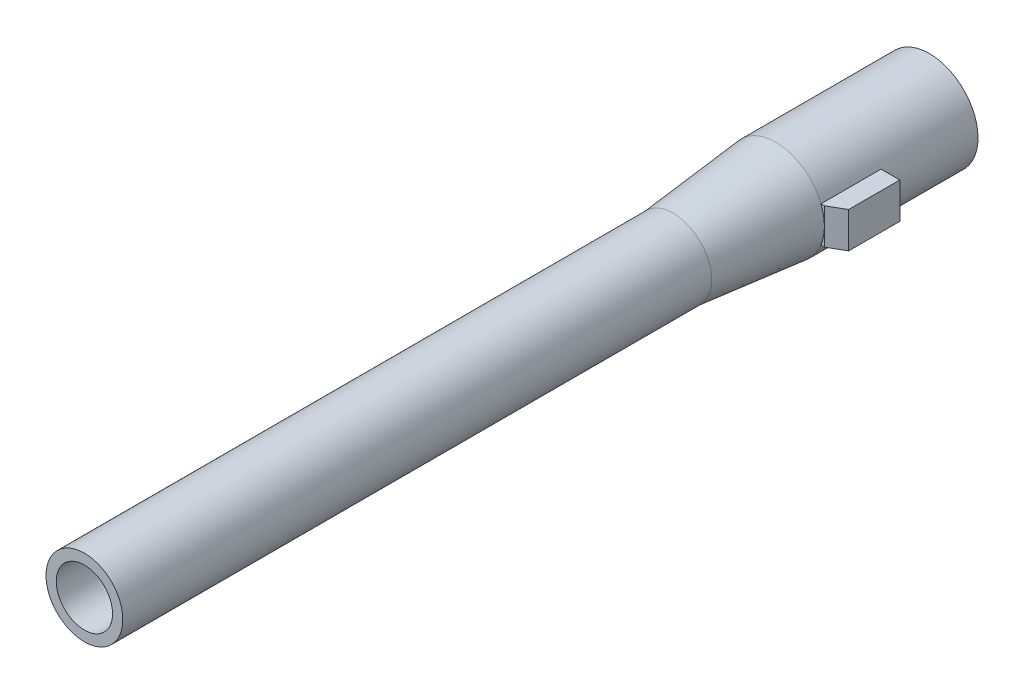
from build123d import *

# Parameters (mm, degrees)
SKETCH1_R                = 9.5
SKETCH1_R_2              = 7.6
BOSS_EXTRUDE1_DEPTH      = 30
BOSS_EXTRUDE4_DEPTH      = 3.5
BOSS_EXTRUDE4_DEPTH_BACK = 3.5


with BuildPart() as part:
    # Sketch1 → Boss-Extrude1 (new body)
    with BuildSketch(Plane.XY):
        Circle(SKETCH1_R)
        Circle(SKETCH1_R_2, mode=Mode.SUBTRACT)
    extrude(amount=BOSS_EXTRUDE1_DEPTH)

    # Sketch4 → Revolve1 (revolve)
    with BuildSketch(Plane(origin=(0, 0, 0), x_dir=(0, 0, -1), z_dir=(1, 0, 0)), mode=Mode.PRIVATE) as revolve1_sk:
        Polygon((-142.80777, 7.5), (-50, 7.5), (-30, 9.5), (-30, 5.75), (-142.80777, 5), (-165, 5.5), (-165, 7.5), align=None)
    revolve(revolve1_sk.sketch.rotate(Axis((0, 0, 30), (0, 0, 1)), 90), axis=Axis((0, 0, 30), (0, 0, 1)))

    # Sketch7 → Boss-Extrude4 (add, two sides: drawn at the far end of the back side and taken through both)
    with BuildSketch(Plane(origin=(0, 0, 0), x_dir=(1, 0, 0), z_dir=(0, 1, 0)).offset(-BOSS_EXTRUDE4_DEPTH_BACK)):
        Polygon((9.5, -18.267949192), (7.6, -18.267949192), (7.6, -30), (9.5, -30), (12.5, -28.267949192), (12.5, -18.267949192), align=None)
    extrude(amount=BOSS_EXTRUDE4_DEPTH + BOSS_EXTRUDE4_DEPTH_BACK)

    # Sketch8 → Cut-Revolve1 (revolve, cut)
    with BuildSketch(Plane(origin=(0, 0, 0), x_dir=(0, 0, -1), z_dir=(1, 0, 0)), mode=Mode.PRIVATE) as cut_revolve1_sk:
        Polygon((-30, 7.6), (-31.862382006, 5.737617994), (-30, 5.75), align=None)
    revolve(cut_revolve1_sk.sketch.rotate(Axis((0, 0, 30), (0, 0, 1)), 90), axis=Axis((0, 0, 30), (0, 0, 1)), mode=Mode.SUBTRACT)


solid = part.part
